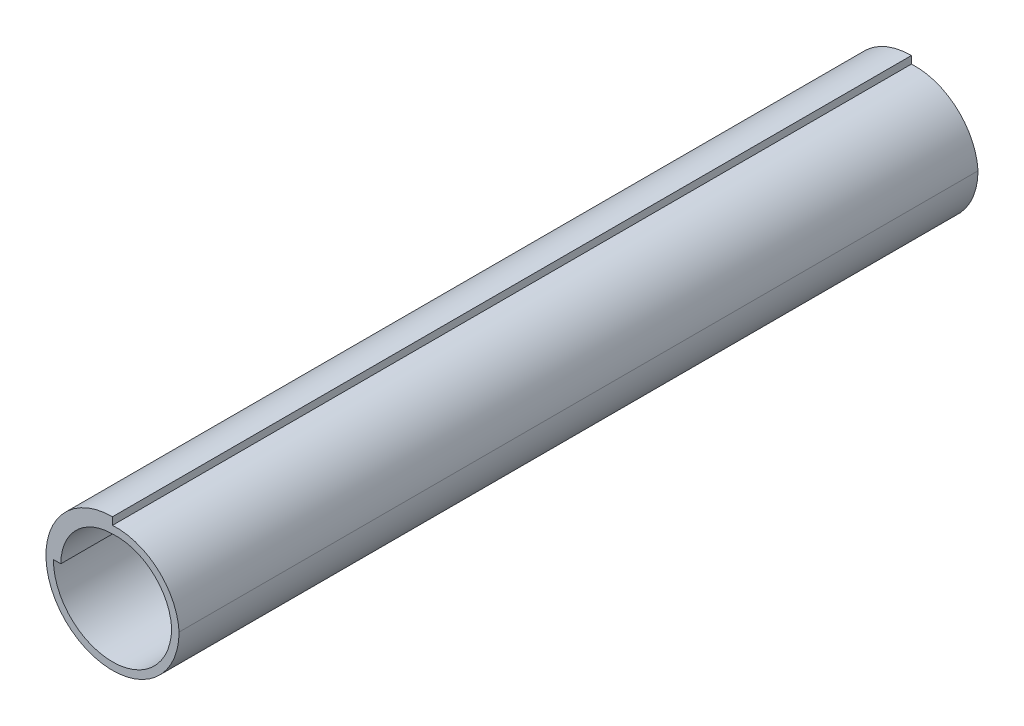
from build123d import *

# Parameters (mm, degrees)
BASE_EXTRUDE_DEPTH = 15


with BuildPart() as part:
    # Sketch1 → Base-Extrude (new, symmetric)
    with BuildSketch(Plane.XY):
        with BuildLine():
            Line((0, 2.22), (0, 2.5))
            ThreePointArc((0, 2.5), (-1.767766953, -1.767766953), (2.5, 0))
            ThreePointArc((2.5, 0), (1.709777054, 1.627766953), (0, 2.22))
        make_face()
        with BuildLine():
            Line((-2.22, 0), (-1.94, 0))
            ThreePointArc((-1.94, 0), (-1.371787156, 1.371787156), (0, 1.94))
            ThreePointArc((0, 1.94), (1.511787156, 1.429777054), (2.22, 0))
            ThreePointArc((2.22, 0), (0, -2.22), (-2.22, 0))
        make_face(mode=Mode.SUBTRACT)
    extrude(amount=BASE_EXTRUDE_DEPTH, both=True)


solid = part.part
